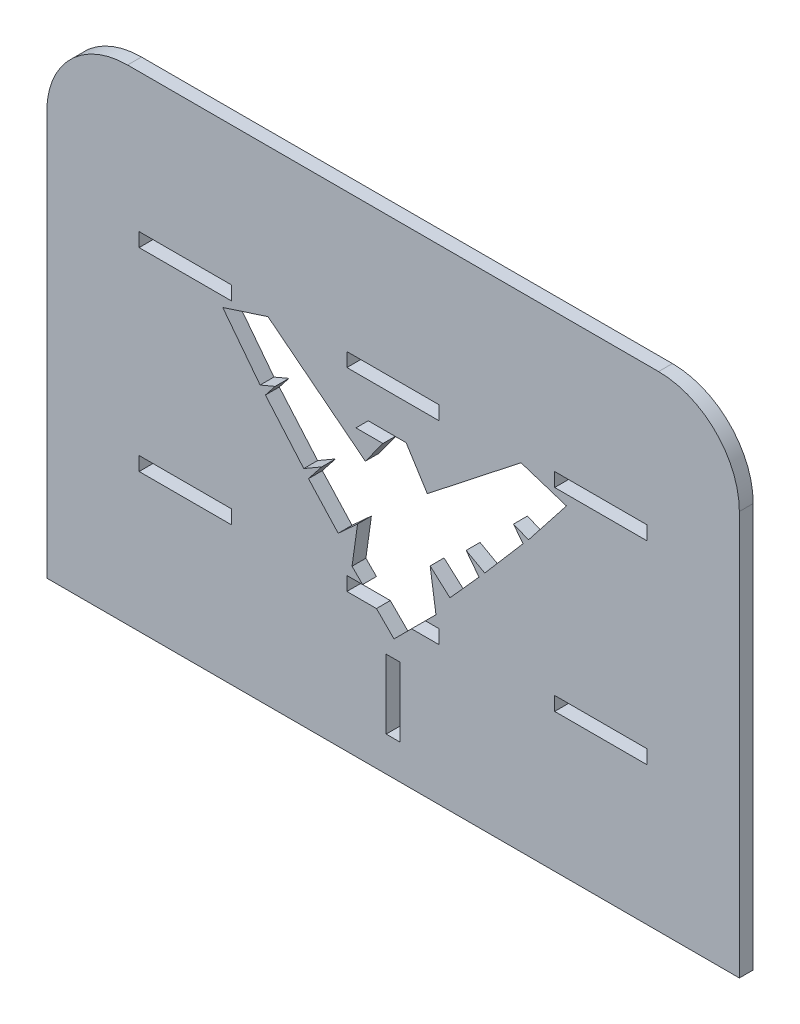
from build123d import *

# Parameters (mm, degrees)
CROQUIS1_W              = 80
CROQUIS1_H              = 12
CROQUIS1_W_2            = 12
CROQUIS1_H_2            = 60
SALIENTE_EXTRUIR1_DEPTH = 12
CORTAR_EXTRUIR1_DEPTH   = 517.278994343


with BuildPart() as part:
    # Croquis1 → Saliente-Extruir1 (new body)
    with BuildSketch(Plane.XY):
        with BuildLine():
            Line((-300, 0), (300, 0))
            Line((300, 0), (300, 350))
            ThreePointArc((300, 350), (279.497474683, 399.497474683), (230, 420))
            Line((230, 420), (-230, 420))
            ThreePointArc((-230, 420), (-279.497474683, 399.497474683), (-300, 350))
            Line((-300, 350), (-300, 0))
        make_face()
        with Locations((-180, 294)):
            Rectangle(CROQUIS1_W, CROQUIS1_H, mode=Mode.SUBTRACT)
        with Locations((180, 294)):
            Rectangle(CROQUIS1_W, CROQUIS1_H, mode=Mode.SUBTRACT)
        with Locations((0, 294)):
            Rectangle(CROQUIS1_W, CROQUIS1_H, mode=Mode.SUBTRACT)
        with Locations((0, 126)):
            Rectangle(CROQUIS1_W, CROQUIS1_H, mode=Mode.SUBTRACT)
        with Locations((180, 126)):
            Rectangle(CROQUIS1_W, CROQUIS1_H, mode=Mode.SUBTRACT)
        with Locations((-180, 126)):
            Rectangle(CROQUIS1_W, CROQUIS1_H, mode=Mode.SUBTRACT)
        with Locations((0, 60)):
            Rectangle(CROQUIS1_W_2, CROQUIS1_H_2, mode=Mode.SUBTRACT)
    extrude(amount=SALIENTE_EXTRUIR1_DEPTH)

    # Croquis2 → Cortar-Extruir1 (cut, through all)
    with BuildSketch(Plane.XY):
        Polygon((29.662745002, 228.209791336), (11.313634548, 257.293131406), (-21.531273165, 257.293131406), (-32.173757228, 246.650647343), (-8.778641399, 246.650647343), (-24.008403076, 225.732661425), (-108.388663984, 292.000234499), (-147.568509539, 279.282842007), (-115.196965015, 237.276909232), (-102.222655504, 242.751461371), (-110.596076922, 232.089361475), (-77.366201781, 193.527759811), (-61.913489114, 202.47581946), (-73.28273945, 187.999051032), (-47.567856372, 159.884910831), (-30.772667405, 175.246800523), (-35.552959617, 141.147437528), (0.804800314, 104.789677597), (37.162560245, 141.147437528), (32.128140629, 175.246800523), (49.269797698, 159.884910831), (74.464930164, 187.999051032), (63.308521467, 202.47581946), (79.419609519, 193.527759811), (112.570806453, 232.089361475), (104.354142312, 242.751461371), (117.331247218, 237.420411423), (150.207676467, 279.282842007), (110.842694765, 292.000234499), align=None)
    extrude(amount=CORTAR_EXTRUIR1_DEPTH, mode=Mode.SUBTRACT)


solid = part.part
